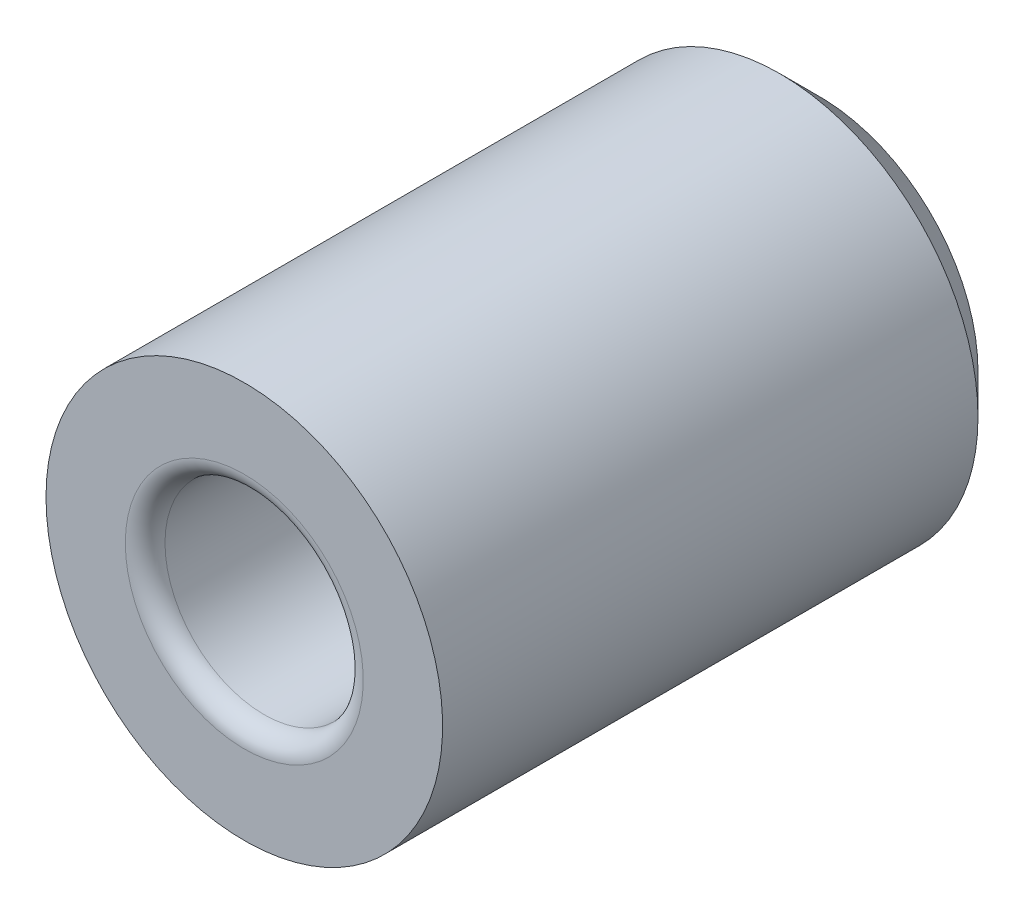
ISO-10303-21;
HEADER;
FILE_DESCRIPTION(('STEP AP214'),'2;1');
FILE_NAME('part.step','',(''),(''),'','','');
FILE_SCHEMA(('AUTOMOTIVE_DESIGN { 1 0 10303 214 1 1 1 1 }'));
ENDSEC;
DATA;
#1=APPLICATION_CONTEXT('core data for automotive mechanical design processes');
#2=APPLICATION_PROTOCOL_DEFINITION('international standard','automotive_design',2000,#1);
#3=PRODUCT_CONTEXT('',#1,'mechanical');
#4=PRODUCT('Part','Part','',(#3));
#5=PRODUCT_RELATED_PRODUCT_CATEGORY('part','',(#4));
#6=PRODUCT_DEFINITION_FORMATION('','',#4);
#7=PRODUCT_DEFINITION_CONTEXT('part definition',#1,'design');
#8=PRODUCT_DEFINITION('design','',#6,#7);
#9=PRODUCT_DEFINITION_SHAPE('','',#8);
#10=(LENGTH_UNIT() NAMED_UNIT(*) SI_UNIT(.MILLI.,.METRE.));
#11=(NAMED_UNIT(*) PLANE_ANGLE_UNIT() SI_UNIT($,.RADIAN.));
#12=(NAMED_UNIT(*) SI_UNIT($,.STERADIAN.) SOLID_ANGLE_UNIT());
#13=UNCERTAINTY_MEASURE_WITH_UNIT(LENGTH_MEASURE(1.E-05),#10,'distance_accuracy_value','');
#14=(GEOMETRIC_REPRESENTATION_CONTEXT(3) GLOBAL_UNCERTAINTY_ASSIGNED_CONTEXT((#13)) GLOBAL_UNIT_ASSIGNED_CONTEXT((#10,
#11,#12)) REPRESENTATION_CONTEXT('',''));
#15=CARTESIAN_POINT('',(0.,0.,0.));
#16=DIRECTION('',(0.,0.,1.));
#17=DIRECTION('',(1.,0.,0.));
#18=AXIS2_PLACEMENT_3D('',#15,#16,#17);
#19=CARTESIAN_POINT('',(0.,0.,-15.));
#20=DIRECTION('',(0.,0.,1.));
#21=DIRECTION('',(1.,0.,0.));
#22=AXIS2_PLACEMENT_3D('',#19,#20,#21);
#23=PLANE('',#22);
#24=CARTESIAN_POINT('',(0.,0.,-15.));
#25=DIRECTION('',(0.,0.,1.));
#26=DIRECTION('',(1.,0.,0.));
#27=AXIS2_PLACEMENT_3D('',#24,#25,#26);
#28=CIRCLE('',#27,4.);
#29=CARTESIAN_POINT('',(3.99999999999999,0.,-15.));
#30=VERTEX_POINT('',#29);
#31=EDGE_CURVE('E42',#30,#30,#28,.F.);
#32=ORIENTED_EDGE('',*,*,#31,.T.);
#33=EDGE_LOOP('',(#32));
#34=FACE_BOUND('',#33,.T.);
#35=CARTESIAN_POINT('',(0.,0.,-15.));
#36=DIRECTION('',(0.,0.,-1.));
#37=DIRECTION('',(-1.,0.,0.));
#38=AXIS2_PLACEMENT_3D('',#35,#36,#37);
#39=CIRCLE('',#38,1.64999999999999);
#40=CARTESIAN_POINT('',(-1.64999999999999,0.,-15.));
#41=VERTEX_POINT('',#40);
#42=EDGE_CURVE('E60',#41,#41,#39,.T.);
#43=ORIENTED_EDGE('',*,*,#42,.F.);
#44=EDGE_LOOP('',(#43));
#45=FACE_BOUND('',#44,.T.);
#46=ADVANCED_FACE('F35',(#34,#45),#23,.F.);
#47=CARTESIAN_POINT('',(0.,0.,-0.5));
#48=DIRECTION('',(0.,0.,-1.));
#49=DIRECTION('',(-1.,0.,0.));
#50=AXIS2_PLACEMENT_3D('',#47,#48,#49);
#51=PLANE('',#50);
#52=CARTESIAN_POINT('',(0.,0.,-0.5));
#53=DIRECTION('',(0.,0.,-1.));
#54=DIRECTION('',(-1.,0.,0.));
#55=AXIS2_PLACEMENT_3D('',#52,#53,#54);
#56=CIRCLE('',#55,3.);
#57=CARTESIAN_POINT('',(-3.,0.,-0.499999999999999));
#58=VERTEX_POINT('',#57);
#59=EDGE_CURVE('E50',#58,#58,#56,.T.);
#60=ORIENTED_EDGE('',*,*,#59,.T.);
#61=EDGE_LOOP('',(#60));
#62=FACE_BOUND('',#61,.T.);
#63=CARTESIAN_POINT('',(0.,0.,-0.5));
#64=DIRECTION('',(0.,0.,-1.));
#65=DIRECTION('',(-1.,0.,0.));
#66=AXIS2_PLACEMENT_3D('',#63,#64,#65);
#67=CIRCLE('',#66,5.);
#68=CARTESIAN_POINT('',(-5.,0.,-0.499999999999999));
#69=VERTEX_POINT('',#68);
#70=EDGE_CURVE('E66',#69,#69,#67,.T.);
#71=ORIENTED_EDGE('',*,*,#70,.F.);
#72=EDGE_LOOP('',(#71));
#73=FACE_BOUND('',#72,.T.);
#74=ADVANCED_FACE('F77',(#62,#73),#51,.F.);
#75=CARTESIAN_POINT('',(0.,0.,-0.5));
#76=DIRECTION('',(0.,0.,-1.));
#77=DIRECTION('',(-1.,0.,0.));
#78=AXIS2_PLACEMENT_3D('',#75,#76,#77);
#79=CYLINDRICAL_SURFACE('',#78,5.);
#80=CARTESIAN_POINT('',(0.,0.,-14.));
#81=DIRECTION('',(0.,0.,1.));
#82=DIRECTION('',(1.,0.,0.));
#83=AXIS2_PLACEMENT_3D('',#80,#81,#82);
#84=CIRCLE('',#83,5.);
#85=CARTESIAN_POINT('',(5.,0.,-14.));
#86=VERTEX_POINT('',#85);
#87=EDGE_CURVE('E10',#86,#86,#84,.T.);
#88=ORIENTED_EDGE('',*,*,#87,.T.);
#89=EDGE_LOOP('',(#88));
#90=FACE_BOUND('',#89,.T.);
#91=ORIENTED_EDGE('',*,*,#70,.T.);
#92=EDGE_LOOP('',(#91));
#93=FACE_BOUND('',#92,.T.);
#94=ADVANCED_FACE('F82',(#90,#93),#79,.T.);
#95=CARTESIAN_POINT('',(0.,0.,-8.));
#96=DIRECTION('',(0.,0.,1.));
#97=DIRECTION('',(1.,0.,0.));
#98=AXIS2_PLACEMENT_3D('',#95,#96,#97);
#99=PLANE('',#98);
#100=CARTESIAN_POINT('',(0.,0.,-8.));
#101=DIRECTION('',(0.,0.,1.));
#102=DIRECTION('',(1.,0.,0.));
#103=AXIS2_PLACEMENT_3D('',#100,#101,#102);
#104=CIRCLE('',#103,1.64999999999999);
#105=CARTESIAN_POINT('',(1.64999999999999,0.,-8.));
#106=VERTEX_POINT('',#105);
#107=EDGE_CURVE('E56',#106,#106,#104,.T.);
#108=ORIENTED_EDGE('',*,*,#107,.F.);
#109=EDGE_LOOP('',(#108));
#110=FACE_BOUND('',#109,.T.);
#111=CARTESIAN_POINT('',(0.,0.,-8.));
#112=DIRECTION('',(0.,0.,1.));
#113=DIRECTION('',(1.,0.,0.));
#114=AXIS2_PLACEMENT_3D('',#111,#112,#113);
#115=CIRCLE('',#114,2.5);
#116=CARTESIAN_POINT('',(2.5,0.,-8.));
#117=VERTEX_POINT('',#116);
#118=EDGE_CURVE('E55',#117,#117,#115,.T.);
#119=ORIENTED_EDGE('',*,*,#118,.T.);
#120=EDGE_LOOP('',(#119));
#121=FACE_BOUND('',#120,.T.);
#122=ADVANCED_FACE('F87',(#110,#121),#99,.T.);
#123=CARTESIAN_POINT('',(0.,0.,-0.5));
#124=DIRECTION('',(0.,0.,-1.));
#125=DIRECTION('',(-1.,0.,0.));
#126=AXIS2_PLACEMENT_3D('',#123,#124,#125);
#127=CYLINDRICAL_SURFACE('',#126,2.5);
#128=CARTESIAN_POINT('',(0.,0.,-1.));
#129=DIRECTION('',(0.,0.,-1.));
#130=DIRECTION('',(-1.,0.,0.));
#131=AXIS2_PLACEMENT_3D('',#128,#129,#130);
#132=CIRCLE('',#131,2.5);
#133=CARTESIAN_POINT('',(-2.5,0.,-1.));
#134=VERTEX_POINT('',#133);
#135=EDGE_CURVE('E46',#134,#134,#132,.F.);
#136=ORIENTED_EDGE('',*,*,#135,.T.);
#137=EDGE_LOOP('',(#136));
#138=FACE_BOUND('',#137,.T.);
#139=CARTESIAN_POINT('',(0.,0.,-5.5));
#140=DIRECTION('',(0.,0.,-1.));
#141=DIRECTION('',(-1.,0.,0.));
#142=AXIS2_PLACEMENT_3D('',#139,#140,#141);
#143=CIRCLE('',#142,2.5);
#144=CARTESIAN_POINT('',(-2.5,0.,-5.5));
#145=VERTEX_POINT('',#144);
#146=EDGE_CURVE('E63',#145,#145,#143,.T.);
#147=ORIENTED_EDGE('',*,*,#146,.T.);
#148=EDGE_LOOP('',(#147));
#149=FACE_BOUND('',#148,.T.);
#150=ADVANCED_FACE('F97',(#138,#149),#127,.F.);
#151=CARTESIAN_POINT('',(0.,0.,-6.75));
#152=DIRECTION('',(0.,0.,1.));
#153=DIRECTION('',(1.,0.,0.));
#154=AXIS2_PLACEMENT_3D('',#151,#152,#153);
#155=TOROIDAL_SURFACE('',#154,2.5,1.25);
#156=ORIENTED_EDGE('',*,*,#118,.F.);
#157=EDGE_LOOP('',(#156));
#158=FACE_BOUND('',#157,.T.);
#159=CARTESIAN_POINT('',(0.,0.,-6.75));
#160=DIRECTION('',(0.,0.,1.));
#161=DIRECTION('',(1.,0.,0.));
#162=AXIS2_PLACEMENT_3D('',#159,#160,#161);
#163=CIRCLE('',#162,3.75);
#164=CARTESIAN_POINT('',(3.75,0.,-6.75));
#165=VERTEX_POINT('',#164);
#166=EDGE_CURVE('E59',#165,#165,#163,.F.);
#167=ORIENTED_EDGE('',*,*,#166,.F.);
#168=EDGE_LOOP('',(#167));
#169=FACE_BOUND('',#168,.T.);
#170=ADVANCED_FACE('F94',(#158,#169),#155,.F.);
#171=CARTESIAN_POINT('',(0.,0.,-6.75));
#172=DIRECTION('',(0.,0.,-1.));
#173=DIRECTION('',(-1.,0.,0.));
#174=AXIS2_PLACEMENT_3D('',#171,#172,#173);
#175=TOROIDAL_SURFACE('',#174,2.5,1.25);
#176=ORIENTED_EDGE('',*,*,#166,.T.);
#177=EDGE_LOOP('',(#176));
#178=FACE_BOUND('',#177,.T.);
#179=ORIENTED_EDGE('',*,*,#146,.F.);
#180=EDGE_LOOP('',(#179));
#181=FACE_BOUND('',#180,.T.);
#182=ADVANCED_FACE('F91',(#178,#181),#175,.F.);
#183=CARTESIAN_POINT('',(0.,0.,-15.));
#184=DIRECTION('',(0.,0.,-1.));
#185=DIRECTION('',(-1.,0.,0.));
#186=AXIS2_PLACEMENT_3D('',#183,#184,#185);
#187=CYLINDRICAL_SURFACE('',#186,1.64999999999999);
#188=ORIENTED_EDGE('',*,*,#107,.T.);
#189=EDGE_LOOP('',(#188));
#190=FACE_BOUND('',#189,.T.);
#191=ORIENTED_EDGE('',*,*,#42,.T.);
#192=EDGE_LOOP('',(#191));
#193=FACE_BOUND('',#192,.T.);
#194=ADVANCED_FACE('F74',(#190,#193),#187,.F.);
#195=CARTESIAN_POINT('',(0.,0.,-1.));
#196=DIRECTION('',(0.,0.,-1.));
#197=DIRECTION('',(-1.,0.,0.));
#198=AXIS2_PLACEMENT_3D('',#195,#196,#197);
#199=TOROIDAL_SURFACE('',#198,3.,0.5);
#200=ORIENTED_EDGE('',*,*,#135,.F.);
#201=EDGE_LOOP('',(#200));
#202=FACE_BOUND('',#201,.T.);
#203=ORIENTED_EDGE('',*,*,#59,.F.);
#204=EDGE_LOOP('',(#203));
#205=FACE_BOUND('',#204,.T.);
#206=ADVANCED_FACE('F99',(#202,#205),#199,.T.);
#207=CARTESIAN_POINT('',(0.,0.,-15.));
#208=DIRECTION('',(0.,0.,1.));
#209=DIRECTION('',(1.,0.,0.));
#210=AXIS2_PLACEMENT_3D('',#207,#208,#209);
#211=CONICAL_SURFACE('',#210,4.,0.785398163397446);
#212=ORIENTED_EDGE('',*,*,#87,.F.);
#213=EDGE_LOOP('',(#212));
#214=FACE_BOUND('',#213,.T.);
#215=ORIENTED_EDGE('',*,*,#31,.F.);
#216=EDGE_LOOP('',(#215));
#217=FACE_BOUND('',#216,.T.);
#218=ADVANCED_FACE('F37',(#214,#217),#211,.T.);
#219=CLOSED_SHELL('',(#46,#74,#94,#122,#150,#170,#182,#194,#206,#218));
#220=MANIFOLD_SOLID_BREP('B2',#219);
#221=ADVANCED_BREP_SHAPE_REPRESENTATION('',(#18,#220),#14);
#222=SHAPE_DEFINITION_REPRESENTATION(#9,#221);
ENDSEC;
END-ISO-10303-21;
